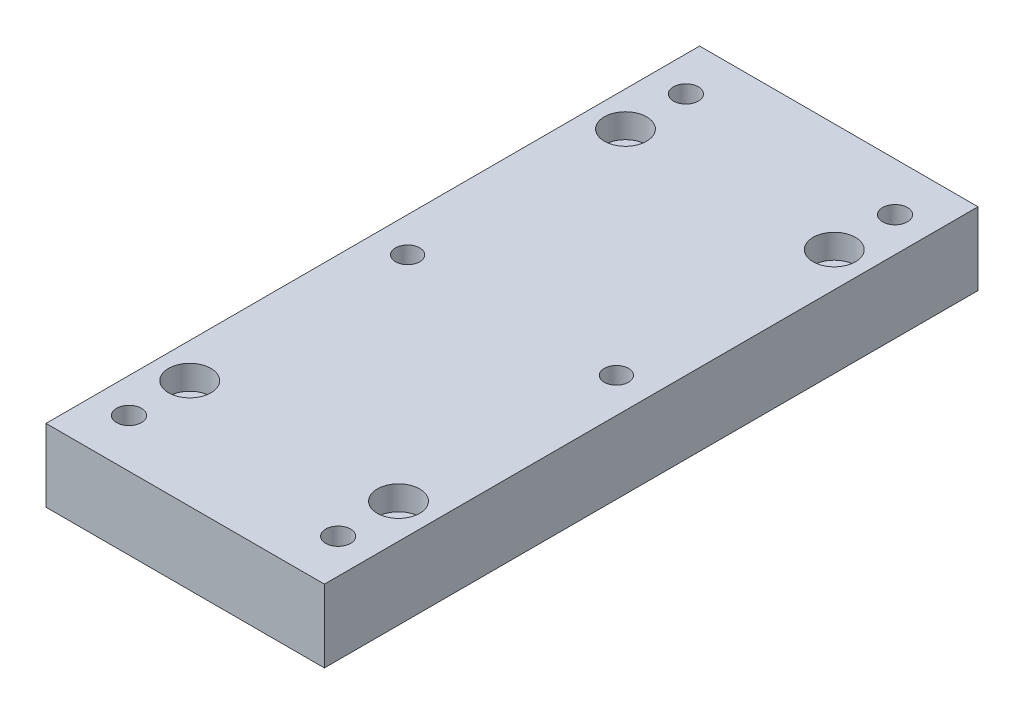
ISO-10303-21;
HEADER;
FILE_DESCRIPTION(('STEP AP214'),'2;1');
FILE_NAME('part.step','',(''),(''),'','','');
FILE_SCHEMA(('AUTOMOTIVE_DESIGN { 1 0 10303 214 1 1 1 1 }'));
ENDSEC;
DATA;
#1=APPLICATION_CONTEXT('core data for automotive mechanical design processes');
#2=APPLICATION_PROTOCOL_DEFINITION('international standard','automotive_design',2000,#1);
#3=PRODUCT_CONTEXT('',#1,'mechanical');
#4=PRODUCT('Part','Part','',(#3));
#5=PRODUCT_RELATED_PRODUCT_CATEGORY('part','',(#4));
#6=PRODUCT_DEFINITION_FORMATION('','',#4);
#7=PRODUCT_DEFINITION_CONTEXT('part definition',#1,'design');
#8=PRODUCT_DEFINITION('design','',#6,#7);
#9=PRODUCT_DEFINITION_SHAPE('','',#8);
#10=(LENGTH_UNIT() NAMED_UNIT(*) SI_UNIT(.MILLI.,.METRE.));
#11=(NAMED_UNIT(*) PLANE_ANGLE_UNIT() SI_UNIT($,.RADIAN.));
#12=(NAMED_UNIT(*) SI_UNIT($,.STERADIAN.) SOLID_ANGLE_UNIT());
#13=UNCERTAINTY_MEASURE_WITH_UNIT(LENGTH_MEASURE(1.E-05),#10,'distance_accuracy_value','');
#14=(GEOMETRIC_REPRESENTATION_CONTEXT(3) GLOBAL_UNCERTAINTY_ASSIGNED_CONTEXT((#13)) GLOBAL_UNIT_ASSIGNED_CONTEXT((#10,
#11,#12)) REPRESENTATION_CONTEXT('',''));
#15=CARTESIAN_POINT('',(0.,0.,0.));
#16=DIRECTION('',(0.,0.,1.));
#17=DIRECTION('',(1.,0.,0.));
#18=AXIS2_PLACEMENT_3D('',#15,#16,#17);
#19=CARTESIAN_POINT('',(0.,19.05,0.));
#20=DIRECTION('',(0.,1.,0.));
#21=DIRECTION('',(0.,0.,1.));
#22=AXIS2_PLACEMENT_3D('',#19,#20,#21);
#23=PLANE('',#22);
#24=CARTESIAN_POINT('',(-27.432,19.05,-73.0376999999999));
#25=DIRECTION('',(0.,1.,0.));
#26=DIRECTION('',(0.,0.,1.));
#27=AXIS2_PLACEMENT_3D('',#24,#25,#26);
#28=CIRCLE('',#27,3.26389999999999);
#29=CARTESIAN_POINT('',(-27.432,19.05,-69.7737999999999));
#30=VERTEX_POINT('',#29);
#31=EDGE_CURVE('E194',#30,#30,#28,.T.);
#32=ORIENTED_EDGE('',*,*,#31,.F.);
#33=EDGE_LOOP('',(#32));
#34=FACE_BOUND('',#33,.T.);
#35=CARTESIAN_POINT('',(27.432,19.05,-73.0376999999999));
#36=DIRECTION('',(0.,1.,0.));
#37=DIRECTION('',(0.,0.,1.));
#38=AXIS2_PLACEMENT_3D('',#35,#36,#37);
#39=CIRCLE('',#38,3.26389999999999);
#40=CARTESIAN_POINT('',(27.432,19.05,-69.7737999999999));
#41=VERTEX_POINT('',#40);
#42=EDGE_CURVE('E188',#41,#41,#39,.T.);
#43=ORIENTED_EDGE('',*,*,#42,.F.);
#44=EDGE_LOOP('',(#43));
#45=FACE_BOUND('',#44,.T.);
#46=CARTESIAN_POINT('',(27.432,19.05,73.0377));
#47=DIRECTION('',(0.,1.,0.));
#48=DIRECTION('',(0.,0.,1.));
#49=AXIS2_PLACEMENT_3D('',#46,#47,#48);
#50=CIRCLE('',#49,3.26389999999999);
#51=CARTESIAN_POINT('',(27.432,19.05,76.3016));
#52=VERTEX_POINT('',#51);
#53=EDGE_CURVE('E182',#52,#52,#50,.T.);
#54=ORIENTED_EDGE('',*,*,#53,.F.);
#55=EDGE_LOOP('',(#54));
#56=FACE_BOUND('',#55,.T.);
#57=CARTESIAN_POINT('',(-27.432,19.05,73.0377));
#58=DIRECTION('',(0.,1.,0.));
#59=DIRECTION('',(0.,0.,1.));
#60=AXIS2_PLACEMENT_3D('',#57,#58,#59);
#61=CIRCLE('',#60,3.26389999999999);
#62=CARTESIAN_POINT('',(-27.432,19.05,76.3016));
#63=VERTEX_POINT('',#62);
#64=EDGE_CURVE('E176',#63,#63,#61,.T.);
#65=ORIENTED_EDGE('',*,*,#64,.F.);
#66=EDGE_LOOP('',(#65));
#67=FACE_BOUND('',#66,.T.);
#68=DIRECTION('',(0.,0.,-1.));
#69=VECTOR('',#68,1.);
#70=CARTESIAN_POINT('',(36.5124999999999,19.05,-85.725));
#71=LINE('',#70,#69);
#72=CARTESIAN_POINT('',(36.5125,19.05,85.725));
#73=VERTEX_POINT('',#72);
#74=CARTESIAN_POINT('',(36.5124999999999,19.05,-85.725));
#75=VERTEX_POINT('',#74);
#76=EDGE_CURVE('E88',#73,#75,#71,.T.);
#77=ORIENTED_EDGE('',*,*,#76,.T.);
#78=DIRECTION('',(-1.,0.,0.));
#79=VECTOR('',#78,1.);
#80=CARTESIAN_POINT('',(-36.5125000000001,19.05,-85.725));
#81=LINE('',#80,#79);
#82=CARTESIAN_POINT('',(-36.5125000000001,19.05,-85.725));
#83=VERTEX_POINT('',#82);
#84=EDGE_CURVE('E83',#75,#83,#81,.T.);
#85=ORIENTED_EDGE('',*,*,#84,.T.);
#86=DIRECTION('',(0.,0.,1.));
#87=VECTOR('',#86,1.);
#88=CARTESIAN_POINT('',(-36.5125000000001,19.05,-85.725));
#89=LINE('',#88,#87);
#90=CARTESIAN_POINT('',(-36.5125,19.05,85.725));
#91=VERTEX_POINT('',#90);
#92=EDGE_CURVE('E86',#83,#91,#89,.T.);
#93=ORIENTED_EDGE('',*,*,#92,.T.);
#94=DIRECTION('',(1.,0.,0.));
#95=VECTOR('',#94,1.);
#96=CARTESIAN_POINT('',(-36.5125,19.05,85.725));
#97=LINE('',#96,#95);
#98=EDGE_CURVE('E53',#91,#73,#97,.T.);
#99=ORIENTED_EDGE('',*,*,#98,.T.);
#100=EDGE_LOOP('',(#77,#85,#93,#99));
#101=FACE_BOUND('',#100,.T.);
#102=CARTESIAN_POINT('',(27.3812,19.05,57.15));
#103=DIRECTION('',(0.,1.,0.));
#104=DIRECTION('',(0.,0.,1.));
#105=AXIS2_PLACEMENT_3D('',#102,#103,#104);
#106=CIRCLE('',#105,5.55624999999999);
#107=CARTESIAN_POINT('',(27.3812,19.05,62.70625));
#108=VERTEX_POINT('',#107);
#109=EDGE_CURVE('E122',#108,#108,#106,.T.);
#110=ORIENTED_EDGE('',*,*,#109,.F.);
#111=EDGE_LOOP('',(#110));
#112=FACE_BOUND('',#111,.T.);
#113=CARTESIAN_POINT('',(27.3812,19.05,-57.15));
#114=DIRECTION('',(0.,1.,0.));
#115=DIRECTION('',(0.,0.,1.));
#116=AXIS2_PLACEMENT_3D('',#113,#114,#115);
#117=CIRCLE('',#116,5.55624999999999);
#118=CARTESIAN_POINT('',(27.3812,19.05,-51.59375));
#119=VERTEX_POINT('',#118);
#120=EDGE_CURVE('E134',#119,#119,#117,.T.);
#121=ORIENTED_EDGE('',*,*,#120,.F.);
#122=EDGE_LOOP('',(#121));
#123=FACE_BOUND('',#122,.T.);
#124=CARTESIAN_POINT('',(-27.3812,19.05,57.15));
#125=DIRECTION('',(0.,1.,0.));
#126=DIRECTION('',(0.,0.,1.));
#127=AXIS2_PLACEMENT_3D('',#124,#125,#126);
#128=CIRCLE('',#127,5.55625);
#129=CARTESIAN_POINT('',(-27.3812,19.05,62.70625));
#130=VERTEX_POINT('',#129);
#131=EDGE_CURVE('E146',#130,#130,#128,.T.);
#132=ORIENTED_EDGE('',*,*,#131,.F.);
#133=EDGE_LOOP('',(#132));
#134=FACE_BOUND('',#133,.T.);
#135=CARTESIAN_POINT('',(-27.3812,19.05,-57.15));
#136=DIRECTION('',(0.,1.,0.));
#137=DIRECTION('',(0.,0.,1.));
#138=AXIS2_PLACEMENT_3D('',#135,#136,#137);
#139=CIRCLE('',#138,5.55625);
#140=CARTESIAN_POINT('',(-27.3812,19.05,-51.59375));
#141=VERTEX_POINT('',#140);
#142=EDGE_CURVE('E158',#141,#141,#139,.T.);
#143=ORIENTED_EDGE('',*,*,#142,.F.);
#144=EDGE_LOOP('',(#143));
#145=FACE_BOUND('',#144,.T.);
#146=CARTESIAN_POINT('',(27.3812,19.05,0.));
#147=DIRECTION('',(0.,-1.,0.));
#148=DIRECTION('',(0.,0.,-1.));
#149=AXIS2_PLACEMENT_3D('',#146,#147,#148);
#150=CIRCLE('',#149,3.175);
#151=CARTESIAN_POINT('',(27.3812,19.05,-3.175));
#152=VERTEX_POINT('',#151);
#153=EDGE_CURVE('E161',#152,#152,#150,.T.);
#154=ORIENTED_EDGE('',*,*,#153,.T.);
#155=EDGE_LOOP('',(#154));
#156=FACE_BOUND('',#155,.T.);
#157=CARTESIAN_POINT('',(-27.3812,19.05,0.));
#158=DIRECTION('',(0.,-1.,0.));
#159=DIRECTION('',(0.,0.,-1.));
#160=AXIS2_PLACEMENT_3D('',#157,#158,#159);
#161=CIRCLE('',#160,3.175);
#162=CARTESIAN_POINT('',(-27.3812,19.05,-3.175));
#163=VERTEX_POINT('',#162);
#164=EDGE_CURVE('E167',#163,#163,#161,.T.);
#165=ORIENTED_EDGE('',*,*,#164,.T.);
#166=EDGE_LOOP('',(#165));
#167=FACE_BOUND('',#166,.T.);
#168=ADVANCED_FACE('F36',(#34,#45,#56,#67,#101,#112,#123,#134,#145,#156,#167),#23,.T.);
#169=CARTESIAN_POINT('',(36.5124999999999,19.05,-85.725));
#170=DIRECTION('',(-1.,0.,0.));
#171=DIRECTION('',(0.,0.,1.));
#172=AXIS2_PLACEMENT_3D('',#169,#170,#171);
#173=PLANE('',#172);
#174=DIRECTION('',(0.,0.,-1.));
#175=VECTOR('',#174,1.);
#176=CARTESIAN_POINT('',(36.5124999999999,0.,-85.725));
#177=LINE('',#176,#175);
#178=CARTESIAN_POINT('',(36.5125,0.,85.725));
#179=VERTEX_POINT('',#178);
#180=CARTESIAN_POINT('',(36.5124999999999,0.,-85.725));
#181=VERTEX_POINT('',#180);
#182=EDGE_CURVE('E100',#179,#181,#177,.T.);
#183=ORIENTED_EDGE('',*,*,#182,.T.);
#184=DIRECTION('',(0.,-1.,0.));
#185=VECTOR('',#184,1.);
#186=CARTESIAN_POINT('',(36.5124999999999,19.05,-85.725));
#187=LINE('',#186,#185);
#188=EDGE_CURVE('E11',#75,#181,#187,.T.);
#189=ORIENTED_EDGE('',*,*,#188,.F.);
#190=ORIENTED_EDGE('',*,*,#76,.F.);
#191=DIRECTION('',(0.,-1.,0.));
#192=VECTOR('',#191,1.);
#193=CARTESIAN_POINT('',(36.5125,19.05,85.725));
#194=LINE('',#193,#192);
#195=EDGE_CURVE('E96',#73,#179,#194,.T.);
#196=ORIENTED_EDGE('',*,*,#195,.T.);
#197=EDGE_LOOP('',(#183,#189,#190,#196));
#198=FACE_BOUND('',#197,.T.);
#199=ADVANCED_FACE('F38',(#198),#173,.F.);
#200=CARTESIAN_POINT('',(-36.5125000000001,19.05,-85.725));
#201=DIRECTION('',(0.,0.,1.));
#202=DIRECTION('',(1.,0.,0.));
#203=AXIS2_PLACEMENT_3D('',#200,#201,#202);
#204=PLANE('',#203);
#205=DIRECTION('',(-1.,0.,0.));
#206=VECTOR('',#205,1.);
#207=CARTESIAN_POINT('',(-36.5125000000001,0.,-85.725));
#208=LINE('',#207,#206);
#209=CARTESIAN_POINT('',(-36.5125000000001,0.,-85.725));
#210=VERTEX_POINT('',#209);
#211=EDGE_CURVE('E92',#181,#210,#208,.T.);
#212=ORIENTED_EDGE('',*,*,#211,.T.);
#213=DIRECTION('',(0.,-1.,0.));
#214=VECTOR('',#213,1.);
#215=CARTESIAN_POINT('',(-36.5125000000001,19.05,-85.725));
#216=LINE('',#215,#214);
#217=EDGE_CURVE('E45',#83,#210,#216,.T.);
#218=ORIENTED_EDGE('',*,*,#217,.F.);
#219=ORIENTED_EDGE('',*,*,#84,.F.);
#220=ORIENTED_EDGE('',*,*,#188,.T.);
#221=EDGE_LOOP('',(#212,#218,#219,#220));
#222=FACE_BOUND('',#221,.T.);
#223=ADVANCED_FACE('F91',(#222),#204,.F.);
#224=CARTESIAN_POINT('',(-36.5125000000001,19.05,-85.725));
#225=DIRECTION('',(1.,0.,0.));
#226=DIRECTION('',(0.,0.,-1.));
#227=AXIS2_PLACEMENT_3D('',#224,#225,#226);
#228=PLANE('',#227);
#229=DIRECTION('',(0.,0.,1.));
#230=VECTOR('',#229,1.);
#231=CARTESIAN_POINT('',(-36.5125000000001,0.,-85.725));
#232=LINE('',#231,#230);
#233=CARTESIAN_POINT('',(-36.5125,0.,85.725));
#234=VERTEX_POINT('',#233);
#235=EDGE_CURVE('E70',#210,#234,#232,.T.);
#236=ORIENTED_EDGE('',*,*,#235,.T.);
#237=DIRECTION('',(0.,-1.,0.));
#238=VECTOR('',#237,1.);
#239=CARTESIAN_POINT('',(-36.5125,19.05,85.725));
#240=LINE('',#239,#238);
#241=EDGE_CURVE('E93',#91,#234,#240,.T.);
#242=ORIENTED_EDGE('',*,*,#241,.F.);
#243=ORIENTED_EDGE('',*,*,#92,.F.);
#244=ORIENTED_EDGE('',*,*,#217,.T.);
#245=EDGE_LOOP('',(#236,#242,#243,#244));
#246=FACE_BOUND('',#245,.T.);
#247=ADVANCED_FACE('F94',(#246),#228,.F.);
#248=CARTESIAN_POINT('',(-36.5125,19.05,85.725));
#249=DIRECTION('',(0.,0.,-1.));
#250=DIRECTION('',(-1.,0.,0.));
#251=AXIS2_PLACEMENT_3D('',#248,#249,#250);
#252=PLANE('',#251);
#253=DIRECTION('',(1.,0.,0.));
#254=VECTOR('',#253,1.);
#255=CARTESIAN_POINT('',(-36.5125,0.,85.725));
#256=LINE('',#255,#254);
#257=EDGE_CURVE('E76',#234,#179,#256,.T.);
#258=ORIENTED_EDGE('',*,*,#257,.T.);
#259=ORIENTED_EDGE('',*,*,#195,.F.);
#260=ORIENTED_EDGE('',*,*,#98,.F.);
#261=ORIENTED_EDGE('',*,*,#241,.T.);
#262=EDGE_LOOP('',(#258,#259,#260,#261));
#263=FACE_BOUND('',#262,.T.);
#264=ADVANCED_FACE('F108',(#263),#252,.F.);
#265=CARTESIAN_POINT('',(0.,0.,0.));
#266=DIRECTION('',(0.,1.,0.));
#267=DIRECTION('',(0.,0.,1.));
#268=AXIS2_PLACEMENT_3D('',#265,#266,#267);
#269=PLANE('',#268);
#270=CARTESIAN_POINT('',(-27.432,0.,-73.0376999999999));
#271=DIRECTION('',(0.,1.,0.));
#272=DIRECTION('',(0.,0.,1.));
#273=AXIS2_PLACEMENT_3D('',#270,#271,#272);
#274=CIRCLE('',#273,3.2639);
#275=CARTESIAN_POINT('',(-27.432,0.,-69.7737999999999));
#276=VERTEX_POINT('',#275);
#277=EDGE_CURVE('E191',#276,#276,#274,.T.);
#278=ORIENTED_EDGE('',*,*,#277,.T.);
#279=EDGE_LOOP('',(#278));
#280=FACE_BOUND('',#279,.T.);
#281=CARTESIAN_POINT('',(27.432,0.,-73.0376999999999));
#282=DIRECTION('',(0.,1.,0.));
#283=DIRECTION('',(0.,0.,1.));
#284=AXIS2_PLACEMENT_3D('',#281,#282,#283);
#285=CIRCLE('',#284,3.2639);
#286=CARTESIAN_POINT('',(27.432,0.,-69.7737999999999));
#287=VERTEX_POINT('',#286);
#288=EDGE_CURVE('E185',#287,#287,#285,.T.);
#289=ORIENTED_EDGE('',*,*,#288,.T.);
#290=EDGE_LOOP('',(#289));
#291=FACE_BOUND('',#290,.T.);
#292=CARTESIAN_POINT('',(27.432,0.,73.0377));
#293=DIRECTION('',(0.,1.,0.));
#294=DIRECTION('',(0.,0.,1.));
#295=AXIS2_PLACEMENT_3D('',#292,#293,#294);
#296=CIRCLE('',#295,3.2639);
#297=CARTESIAN_POINT('',(27.432,0.,76.3016));
#298=VERTEX_POINT('',#297);
#299=EDGE_CURVE('E179',#298,#298,#296,.T.);
#300=ORIENTED_EDGE('',*,*,#299,.T.);
#301=EDGE_LOOP('',(#300));
#302=FACE_BOUND('',#301,.T.);
#303=CARTESIAN_POINT('',(-27.432,0.,73.0377));
#304=DIRECTION('',(0.,1.,0.));
#305=DIRECTION('',(0.,0.,1.));
#306=AXIS2_PLACEMENT_3D('',#303,#304,#305);
#307=CIRCLE('',#306,3.2639);
#308=CARTESIAN_POINT('',(-27.432,0.,76.3016));
#309=VERTEX_POINT('',#308);
#310=EDGE_CURVE('E173',#309,#309,#307,.T.);
#311=ORIENTED_EDGE('',*,*,#310,.T.);
#312=EDGE_LOOP('',(#311));
#313=FACE_BOUND('',#312,.T.);
#314=CARTESIAN_POINT('',(-27.3812,0.,0.));
#315=DIRECTION('',(0.,-1.,0.));
#316=DIRECTION('',(0.,0.,-1.));
#317=AXIS2_PLACEMENT_3D('',#314,#315,#316);
#318=CIRCLE('',#317,3.175);
#319=CARTESIAN_POINT('',(-27.3812,0.,-3.175));
#320=VERTEX_POINT('',#319);
#321=EDGE_CURVE('E170',#320,#320,#318,.T.);
#322=ORIENTED_EDGE('',*,*,#321,.F.);
#323=EDGE_LOOP('',(#322));
#324=FACE_BOUND('',#323,.T.);
#325=CARTESIAN_POINT('',(27.3812,0.,0.));
#326=DIRECTION('',(0.,-1.,0.));
#327=DIRECTION('',(0.,0.,-1.));
#328=AXIS2_PLACEMENT_3D('',#325,#326,#327);
#329=CIRCLE('',#328,3.175);
#330=CARTESIAN_POINT('',(27.3812,0.,-3.175));
#331=VERTEX_POINT('',#330);
#332=EDGE_CURVE('E164',#331,#331,#329,.T.);
#333=ORIENTED_EDGE('',*,*,#332,.F.);
#334=EDGE_LOOP('',(#333));
#335=FACE_BOUND('',#334,.T.);
#336=CARTESIAN_POINT('',(-27.3812,0.,-57.15));
#337=DIRECTION('',(0.,1.,0.));
#338=DIRECTION('',(0.,0.,1.));
#339=AXIS2_PLACEMENT_3D('',#336,#337,#338);
#340=CIRCLE('',#339,3.37819999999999);
#341=CARTESIAN_POINT('',(-27.3812,0.,-53.7718));
#342=VERTEX_POINT('',#341);
#343=EDGE_CURVE('E149',#342,#342,#340,.T.);
#344=ORIENTED_EDGE('',*,*,#343,.T.);
#345=EDGE_LOOP('',(#344));
#346=FACE_BOUND('',#345,.T.);
#347=CARTESIAN_POINT('',(-27.3812,0.,57.15));
#348=DIRECTION('',(0.,1.,0.));
#349=DIRECTION('',(0.,0.,1.));
#350=AXIS2_PLACEMENT_3D('',#347,#348,#349);
#351=CIRCLE('',#350,3.37819999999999);
#352=CARTESIAN_POINT('',(-27.3812,0.,60.5282));
#353=VERTEX_POINT('',#352);
#354=EDGE_CURVE('E137',#353,#353,#351,.T.);
#355=ORIENTED_EDGE('',*,*,#354,.T.);
#356=EDGE_LOOP('',(#355));
#357=FACE_BOUND('',#356,.T.);
#358=CARTESIAN_POINT('',(27.3812,0.,-57.15));
#359=DIRECTION('',(0.,1.,0.));
#360=DIRECTION('',(0.,0.,1.));
#361=AXIS2_PLACEMENT_3D('',#358,#359,#360);
#362=CIRCLE('',#361,3.37819999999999);
#363=CARTESIAN_POINT('',(27.3812,0.,-53.7718));
#364=VERTEX_POINT('',#363);
#365=EDGE_CURVE('E125',#364,#364,#362,.T.);
#366=ORIENTED_EDGE('',*,*,#365,.T.);
#367=EDGE_LOOP('',(#366));
#368=FACE_BOUND('',#367,.T.);
#369=CARTESIAN_POINT('',(27.3812,0.,57.15));
#370=DIRECTION('',(0.,1.,0.));
#371=DIRECTION('',(0.,0.,1.));
#372=AXIS2_PLACEMENT_3D('',#369,#370,#371);
#373=CIRCLE('',#372,3.37819999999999);
#374=CARTESIAN_POINT('',(27.3812,0.,60.5282));
#375=VERTEX_POINT('',#374);
#376=EDGE_CURVE('E103',#375,#375,#373,.T.);
#377=ORIENTED_EDGE('',*,*,#376,.T.);
#378=EDGE_LOOP('',(#377));
#379=FACE_BOUND('',#378,.T.);
#380=ORIENTED_EDGE('',*,*,#182,.F.);
#381=ORIENTED_EDGE('',*,*,#257,.F.);
#382=ORIENTED_EDGE('',*,*,#235,.F.);
#383=ORIENTED_EDGE('',*,*,#211,.F.);
#384=EDGE_LOOP('',(#380,#381,#382,#383));
#385=FACE_BOUND('',#384,.T.);
#386=ADVANCED_FACE('F111',(#280,#291,#302,#313,#324,#335,#346,#357,#368,#379,#385),#269,.F.);
#387=CARTESIAN_POINT('',(27.3812,19.05,57.15));
#388=DIRECTION('',(0.,1.,0.));
#389=DIRECTION('',(0.,0.,1.));
#390=AXIS2_PLACEMENT_3D('',#387,#388,#389);
#391=CYLINDRICAL_SURFACE('',#390,3.3782);
#392=ORIENTED_EDGE('',*,*,#376,.F.);
#393=EDGE_LOOP('',(#392));
#394=FACE_BOUND('',#393,.T.);
#395=CARTESIAN_POINT('',(27.3812,12.7,57.15));
#396=DIRECTION('',(0.,1.,0.));
#397=DIRECTION('',(0.,0.,1.));
#398=AXIS2_PLACEMENT_3D('',#395,#396,#397);
#399=CIRCLE('',#398,3.3782);
#400=CARTESIAN_POINT('',(27.3812,12.7,60.5282));
#401=VERTEX_POINT('',#400);
#402=EDGE_CURVE('E116',#401,#401,#399,.T.);
#403=ORIENTED_EDGE('',*,*,#402,.T.);
#404=EDGE_LOOP('',(#403));
#405=FACE_BOUND('',#404,.T.);
#406=ADVANCED_FACE('F274',(#394,#405),#391,.F.);
#407=CARTESIAN_POINT('',(30.7594,12.7,57.15));
#408=DIRECTION('',(0.,-1.,0.));
#409=DIRECTION('',(0.,0.,-1.));
#410=AXIS2_PLACEMENT_3D('',#407,#408,#409);
#411=PLANE('',#410);
#412=ORIENTED_EDGE('',*,*,#402,.F.);
#413=EDGE_LOOP('',(#412));
#414=FACE_BOUND('',#413,.T.);
#415=CARTESIAN_POINT('',(27.3812,12.7,57.15));
#416=DIRECTION('',(0.,1.,0.));
#417=DIRECTION('',(0.,0.,1.));
#418=AXIS2_PLACEMENT_3D('',#415,#416,#417);
#419=CIRCLE('',#418,5.55624999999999);
#420=CARTESIAN_POINT('',(27.3812,12.7,62.70625));
#421=VERTEX_POINT('',#420);
#422=EDGE_CURVE('E119',#421,#421,#419,.T.);
#423=ORIENTED_EDGE('',*,*,#422,.T.);
#424=EDGE_LOOP('',(#423));
#425=FACE_BOUND('',#424,.T.);
#426=ADVANCED_FACE('F270',(#414,#425),#411,.F.);
#427=CARTESIAN_POINT('',(27.3812,19.05,57.15));
#428=DIRECTION('',(0.,1.,0.));
#429=DIRECTION('',(0.,0.,1.));
#430=AXIS2_PLACEMENT_3D('',#427,#428,#429);
#431=CYLINDRICAL_SURFACE('',#430,5.55624999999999);
#432=ORIENTED_EDGE('',*,*,#422,.F.);
#433=EDGE_LOOP('',(#432));
#434=FACE_BOUND('',#433,.T.);
#435=ORIENTED_EDGE('',*,*,#109,.T.);
#436=EDGE_LOOP('',(#435));
#437=FACE_BOUND('',#436,.T.);
#438=ADVANCED_FACE('F266',(#434,#437),#431,.F.);
#439=CARTESIAN_POINT('',(27.3812,19.05,-57.15));
#440=DIRECTION('',(0.,1.,0.));
#441=DIRECTION('',(0.,0.,1.));
#442=AXIS2_PLACEMENT_3D('',#439,#440,#441);
#443=CYLINDRICAL_SURFACE('',#442,3.3782);
#444=ORIENTED_EDGE('',*,*,#365,.F.);
#445=EDGE_LOOP('',(#444));
#446=FACE_BOUND('',#445,.T.);
#447=CARTESIAN_POINT('',(27.3812,12.7,-57.15));
#448=DIRECTION('',(0.,1.,0.));
#449=DIRECTION('',(0.,0.,1.));
#450=AXIS2_PLACEMENT_3D('',#447,#448,#449);
#451=CIRCLE('',#450,3.3782);
#452=CARTESIAN_POINT('',(27.3812,12.7,-53.7718));
#453=VERTEX_POINT('',#452);
#454=EDGE_CURVE('E128',#453,#453,#451,.T.);
#455=ORIENTED_EDGE('',*,*,#454,.T.);
#456=EDGE_LOOP('',(#455));
#457=FACE_BOUND('',#456,.T.);
#458=ADVANCED_FACE('F262',(#446,#457),#443,.F.);
#459=CARTESIAN_POINT('',(30.7594,12.7,-57.15));
#460=DIRECTION('',(0.,-1.,0.));
#461=DIRECTION('',(0.,0.,-1.));
#462=AXIS2_PLACEMENT_3D('',#459,#460,#461);
#463=PLANE('',#462);
#464=ORIENTED_EDGE('',*,*,#454,.F.);
#465=EDGE_LOOP('',(#464));
#466=FACE_BOUND('',#465,.T.);
#467=CARTESIAN_POINT('',(27.3812,12.7,-57.15));
#468=DIRECTION('',(0.,1.,0.));
#469=DIRECTION('',(0.,0.,1.));
#470=AXIS2_PLACEMENT_3D('',#467,#468,#469);
#471=CIRCLE('',#470,5.55624999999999);
#472=CARTESIAN_POINT('',(27.3812,12.7,-51.59375));
#473=VERTEX_POINT('',#472);
#474=EDGE_CURVE('E131',#473,#473,#471,.T.);
#475=ORIENTED_EDGE('',*,*,#474,.T.);
#476=EDGE_LOOP('',(#475));
#477=FACE_BOUND('',#476,.T.);
#478=ADVANCED_FACE('F258',(#466,#477),#463,.F.);
#479=CARTESIAN_POINT('',(27.3812,19.05,-57.15));
#480=DIRECTION('',(0.,1.,0.));
#481=DIRECTION('',(0.,0.,1.));
#482=AXIS2_PLACEMENT_3D('',#479,#480,#481);
#483=CYLINDRICAL_SURFACE('',#482,5.55624999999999);
#484=ORIENTED_EDGE('',*,*,#474,.F.);
#485=EDGE_LOOP('',(#484));
#486=FACE_BOUND('',#485,.T.);
#487=ORIENTED_EDGE('',*,*,#120,.T.);
#488=EDGE_LOOP('',(#487));
#489=FACE_BOUND('',#488,.T.);
#490=ADVANCED_FACE('F254',(#486,#489),#483,.F.);
#491=CARTESIAN_POINT('',(-27.3812,19.05,57.15));
#492=DIRECTION('',(0.,1.,0.));
#493=DIRECTION('',(0.,0.,1.));
#494=AXIS2_PLACEMENT_3D('',#491,#492,#493);
#495=CYLINDRICAL_SURFACE('',#494,3.3782);
#496=ORIENTED_EDGE('',*,*,#354,.F.);
#497=EDGE_LOOP('',(#496));
#498=FACE_BOUND('',#497,.T.);
#499=CARTESIAN_POINT('',(-27.3812,12.7,57.15));
#500=DIRECTION('',(0.,1.,0.));
#501=DIRECTION('',(0.,0.,1.));
#502=AXIS2_PLACEMENT_3D('',#499,#500,#501);
#503=CIRCLE('',#502,3.3782);
#504=CARTESIAN_POINT('',(-27.3812,12.7,60.5282));
#505=VERTEX_POINT('',#504);
#506=EDGE_CURVE('E140',#505,#505,#503,.T.);
#507=ORIENTED_EDGE('',*,*,#506,.T.);
#508=EDGE_LOOP('',(#507));
#509=FACE_BOUND('',#508,.T.);
#510=ADVANCED_FACE('F250',(#498,#509),#495,.F.);
#511=CARTESIAN_POINT('',(-24.003,12.7,57.15));
#512=DIRECTION('',(0.,-1.,0.));
#513=DIRECTION('',(0.,0.,-1.));
#514=AXIS2_PLACEMENT_3D('',#511,#512,#513);
#515=PLANE('',#514);
#516=ORIENTED_EDGE('',*,*,#506,.F.);
#517=EDGE_LOOP('',(#516));
#518=FACE_BOUND('',#517,.T.);
#519=CARTESIAN_POINT('',(-27.3812,12.7,57.15));
#520=DIRECTION('',(0.,1.,0.));
#521=DIRECTION('',(0.,0.,1.));
#522=AXIS2_PLACEMENT_3D('',#519,#520,#521);
#523=CIRCLE('',#522,5.55625);
#524=CARTESIAN_POINT('',(-27.3812,12.7,62.70625));
#525=VERTEX_POINT('',#524);
#526=EDGE_CURVE('E143',#525,#525,#523,.T.);
#527=ORIENTED_EDGE('',*,*,#526,.T.);
#528=EDGE_LOOP('',(#527));
#529=FACE_BOUND('',#528,.T.);
#530=ADVANCED_FACE('F246',(#518,#529),#515,.F.);
#531=CARTESIAN_POINT('',(-27.3812,19.05,57.15));
#532=DIRECTION('',(0.,1.,0.));
#533=DIRECTION('',(0.,0.,1.));
#534=AXIS2_PLACEMENT_3D('',#531,#532,#533);
#535=CYLINDRICAL_SURFACE('',#534,5.55625);
#536=ORIENTED_EDGE('',*,*,#526,.F.);
#537=EDGE_LOOP('',(#536));
#538=FACE_BOUND('',#537,.T.);
#539=ORIENTED_EDGE('',*,*,#131,.T.);
#540=EDGE_LOOP('',(#539));
#541=FACE_BOUND('',#540,.T.);
#542=ADVANCED_FACE('F242',(#538,#541),#535,.F.);
#543=CARTESIAN_POINT('',(-27.3812,19.05,-57.15));
#544=DIRECTION('',(0.,1.,0.));
#545=DIRECTION('',(0.,0.,1.));
#546=AXIS2_PLACEMENT_3D('',#543,#544,#545);
#547=CYLINDRICAL_SURFACE('',#546,3.3782);
#548=ORIENTED_EDGE('',*,*,#343,.F.);
#549=EDGE_LOOP('',(#548));
#550=FACE_BOUND('',#549,.T.);
#551=CARTESIAN_POINT('',(-27.3812,12.7,-57.15));
#552=DIRECTION('',(0.,1.,0.));
#553=DIRECTION('',(0.,0.,1.));
#554=AXIS2_PLACEMENT_3D('',#551,#552,#553);
#555=CIRCLE('',#554,3.3782);
#556=CARTESIAN_POINT('',(-27.3812,12.7,-53.7718));
#557=VERTEX_POINT('',#556);
#558=EDGE_CURVE('E152',#557,#557,#555,.T.);
#559=ORIENTED_EDGE('',*,*,#558,.T.);
#560=EDGE_LOOP('',(#559));
#561=FACE_BOUND('',#560,.T.);
#562=ADVANCED_FACE('F238',(#550,#561),#547,.F.);
#563=CARTESIAN_POINT('',(-24.003,12.7,-57.15));
#564=DIRECTION('',(0.,-1.,0.));
#565=DIRECTION('',(0.,0.,-1.));
#566=AXIS2_PLACEMENT_3D('',#563,#564,#565);
#567=PLANE('',#566);
#568=ORIENTED_EDGE('',*,*,#558,.F.);
#569=EDGE_LOOP('',(#568));
#570=FACE_BOUND('',#569,.T.);
#571=CARTESIAN_POINT('',(-27.3812,12.7,-57.15));
#572=DIRECTION('',(0.,1.,0.));
#573=DIRECTION('',(0.,0.,1.));
#574=AXIS2_PLACEMENT_3D('',#571,#572,#573);
#575=CIRCLE('',#574,5.55625);
#576=CARTESIAN_POINT('',(-27.3812,12.7,-51.59375));
#577=VERTEX_POINT('',#576);
#578=EDGE_CURVE('E155',#577,#577,#575,.T.);
#579=ORIENTED_EDGE('',*,*,#578,.T.);
#580=EDGE_LOOP('',(#579));
#581=FACE_BOUND('',#580,.T.);
#582=ADVANCED_FACE('F234',(#570,#581),#567,.F.);
#583=CARTESIAN_POINT('',(-27.3812,19.05,-57.15));
#584=DIRECTION('',(0.,1.,0.));
#585=DIRECTION('',(0.,0.,1.));
#586=AXIS2_PLACEMENT_3D('',#583,#584,#585);
#587=CYLINDRICAL_SURFACE('',#586,5.55625);
#588=ORIENTED_EDGE('',*,*,#578,.F.);
#589=EDGE_LOOP('',(#588));
#590=FACE_BOUND('',#589,.T.);
#591=ORIENTED_EDGE('',*,*,#142,.T.);
#592=EDGE_LOOP('',(#591));
#593=FACE_BOUND('',#592,.T.);
#594=ADVANCED_FACE('F230',(#590,#593),#587,.F.);
#595=CARTESIAN_POINT('',(27.3812,0.,0.));
#596=DIRECTION('',(0.,-1.,0.));
#597=DIRECTION('',(0.,0.,-1.));
#598=AXIS2_PLACEMENT_3D('',#595,#596,#597);
#599=CYLINDRICAL_SURFACE('',#598,3.175);
#600=ORIENTED_EDGE('',*,*,#153,.F.);
#601=EDGE_LOOP('',(#600));
#602=FACE_BOUND('',#601,.T.);
#603=ORIENTED_EDGE('',*,*,#332,.T.);
#604=EDGE_LOOP('',(#603));
#605=FACE_BOUND('',#604,.T.);
#606=ADVANCED_FACE('F222',(#602,#605),#599,.F.);
#607=CARTESIAN_POINT('',(-27.3812,0.,0.));
#608=DIRECTION('',(0.,-1.,0.));
#609=DIRECTION('',(0.,0.,-1.));
#610=AXIS2_PLACEMENT_3D('',#607,#608,#609);
#611=CYLINDRICAL_SURFACE('',#610,3.175);
#612=ORIENTED_EDGE('',*,*,#164,.F.);
#613=EDGE_LOOP('',(#612));
#614=FACE_BOUND('',#613,.T.);
#615=ORIENTED_EDGE('',*,*,#321,.T.);
#616=EDGE_LOOP('',(#615));
#617=FACE_BOUND('',#616,.T.);
#618=ADVANCED_FACE('F212',(#614,#617),#611,.F.);
#619=CARTESIAN_POINT('',(-27.432,19.05,73.0377));
#620=DIRECTION('',(0.,1.,0.));
#621=DIRECTION('',(0.,0.,1.));
#622=AXIS2_PLACEMENT_3D('',#619,#620,#621);
#623=CYLINDRICAL_SURFACE('',#622,3.26389999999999);
#624=ORIENTED_EDGE('',*,*,#310,.F.);
#625=EDGE_LOOP('',(#624));
#626=FACE_BOUND('',#625,.T.);
#627=ORIENTED_EDGE('',*,*,#64,.T.);
#628=EDGE_LOOP('',(#627));
#629=FACE_BOUND('',#628,.T.);
#630=ADVANCED_FACE('F209',(#626,#629),#623,.F.);
#631=CARTESIAN_POINT('',(27.432,19.05,73.0377));
#632=DIRECTION('',(0.,1.,0.));
#633=DIRECTION('',(0.,0.,1.));
#634=AXIS2_PLACEMENT_3D('',#631,#632,#633);
#635=CYLINDRICAL_SURFACE('',#634,3.26389999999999);
#636=ORIENTED_EDGE('',*,*,#299,.F.);
#637=EDGE_LOOP('',(#636));
#638=FACE_BOUND('',#637,.T.);
#639=ORIENTED_EDGE('',*,*,#53,.T.);
#640=EDGE_LOOP('',(#639));
#641=FACE_BOUND('',#640,.T.);
#642=ADVANCED_FACE('F211',(#638,#641),#635,.F.);
#643=CARTESIAN_POINT('',(27.432,19.05,-73.0376999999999));
#644=DIRECTION('',(0.,1.,0.));
#645=DIRECTION('',(0.,0.,1.));
#646=AXIS2_PLACEMENT_3D('',#643,#644,#645);
#647=CYLINDRICAL_SURFACE('',#646,3.26389999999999);
#648=ORIENTED_EDGE('',*,*,#288,.F.);
#649=EDGE_LOOP('',(#648));
#650=FACE_BOUND('',#649,.T.);
#651=ORIENTED_EDGE('',*,*,#42,.T.);
#652=EDGE_LOOP('',(#651));
#653=FACE_BOUND('',#652,.T.);
#654=ADVANCED_FACE('F219',(#650,#653),#647,.F.);
#655=CARTESIAN_POINT('',(-27.432,19.05,-73.0376999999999));
#656=DIRECTION('',(0.,1.,0.));
#657=DIRECTION('',(0.,0.,1.));
#658=AXIS2_PLACEMENT_3D('',#655,#656,#657);
#659=CYLINDRICAL_SURFACE('',#658,3.26389999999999);
#660=ORIENTED_EDGE('',*,*,#277,.F.);
#661=EDGE_LOOP('',(#660));
#662=FACE_BOUND('',#661,.T.);
#663=ORIENTED_EDGE('',*,*,#31,.T.);
#664=EDGE_LOOP('',(#663));
#665=FACE_BOUND('',#664,.T.);
#666=ADVANCED_FACE('F198',(#662,#665),#659,.F.);
#667=CLOSED_SHELL('',(#168,#199,#223,#247,#264,#386,#406,#426,#438,#458,#478,#490,#510,#530,
#542,#562,#582,#594,#606,#618,#630,#642,#654,#666));
#668=MANIFOLD_SOLID_BREP('B2',#667);
#669=ADVANCED_BREP_SHAPE_REPRESENTATION('',(#18,#668),#14);
#670=SHAPE_DEFINITION_REPRESENTATION(#9,#669);
ENDSEC;
END-ISO-10303-21;
